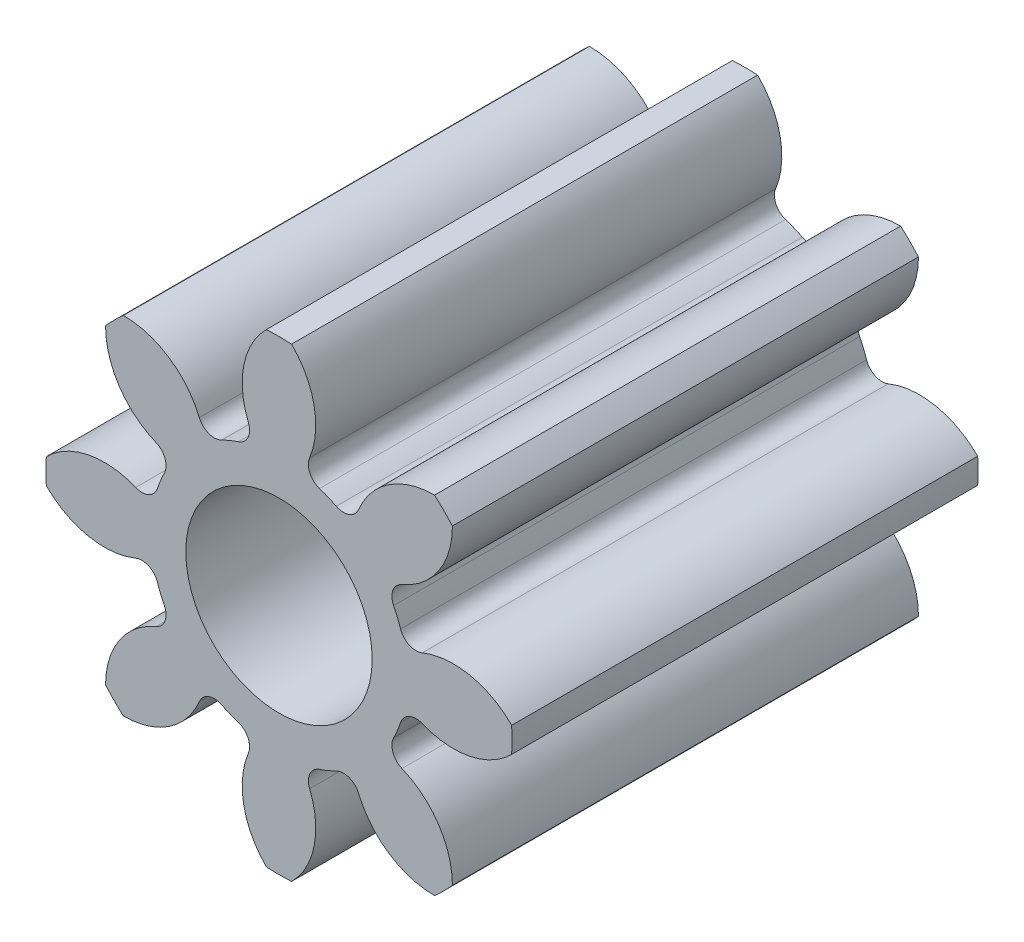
from build123d import *

# Parameters (mm, degrees)
BOSS_EXTRU_1_DEPTH                 = 5
CONG_1_R                           = 0.175
R_P_TITION_CIRCULAIRE4_COUNT       = 8
CONG_1_OF_R_P_TITION_CIRCULAIRE4_R = 0.175
ESQUISSE10_R                       = 1
ENL_V_MAT_EXTRU_4_DEPTH            = 8.029233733


with BuildPart() as part:
    # Esquisse3 → Boss.-Extru.1 (new body)
    with BuildSketch(Plane.XY):
        with BuildLine():
            Line((-1.904896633, 0.709981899), (-1.378706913, -0.560352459))
            Line((-1.378706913, -0.560352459), (-0.852517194, 0.709981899))
            ThreePointArc((-0.852517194, 0.709981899), (-0.999269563, 0.761257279), (-1.150871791, 0.795640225))
            ThreePointArc((-1.150871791, 0.795640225), (-0.986845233, 1.382889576), (-1.243458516, 1.935986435))
            ThreePointArc((-1.243458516, 1.935986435), (-1.378706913, 1.939647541), (-1.51395531, 1.935986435))
            ThreePointArc((-1.51395531, 1.935986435), (-1.770568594, 1.382889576), (-1.606542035, 0.795640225))
            ThreePointArc((-1.606542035, 0.795640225), (-1.758144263, 0.761257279), (-1.904896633, 0.709981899))
        make_face()
    boss_extru_1 = extrude(amount=BOSS_EXTRU_1_DEPTH)

    # Cong_1
    cong_1_edges = [part.edges().sort_by_distance(p)[0] for p in [
        (-1.606542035, 0.795640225, 2.5),
        (-1.150871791, 0.795640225, 2.5),
    ]]
    fillet(cong_1_edges, radius=CONG_1_R)

    # R_p_tition circulaire4: Boss.-Extru.1 ×8 about axis
    r_p_tition_circulaire4_axis = Axis((-1.378706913, -0.560352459, 0), (0, 0, 1))
    for i in range(1, R_P_TITION_CIRCULAIRE4_COUNT):
        add(boss_extru_1.rotate(r_p_tition_circulaire4_axis, i * 360 / R_P_TITION_CIRCULAIRE4_COUNT))

    # Cong_1 of R_p_tition circulaire4
    cong_1_of_r_p_tition_circulaire4_edges = [part.edges().sort_by_distance(p)[0] for p in [
        (-2.498642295, 0.237375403, 2.5),
        (-2.176434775, 0.559582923, 2.5),
        (-2.734699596, -0.788187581, 2.5),
        (-2.734699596, -0.332517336, 2.5),
        (-2.176434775, -1.68028784, 2.5),
        (-2.498642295, -1.35808032, 2.5),
        (-1.150871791, -1.916345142, 2.5),
        (-1.606542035, -1.916345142, 2.5),
        (-0.258771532, -1.35808032, 2.5),
        (-0.580979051, -1.68028784, 2.5),
        (-0.02271423, -0.332517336, 2.5),
        (-0.02271423, -0.788187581, 2.5),
        (-0.580979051, 0.559582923, 2.5),
        (-0.258771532, 0.237375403, 2.5),
    ]]
    fillet(cong_1_of_r_p_tition_circulaire4_edges, radius=CONG_1_OF_R_P_TITION_CIRCULAIRE4_R)

    # Esquisse10 → Enl_v. mat.-Extru.4 (cut, through all)
    with BuildSketch(Plane.XY):
        with Locations((-1.378706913, -0.560352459)):
            Circle(ESQUISSE10_R)
    extrude(amount=ENL_V_MAT_EXTRU_4_DEPTH, mode=Mode.SUBTRACT)


solid = part.part
